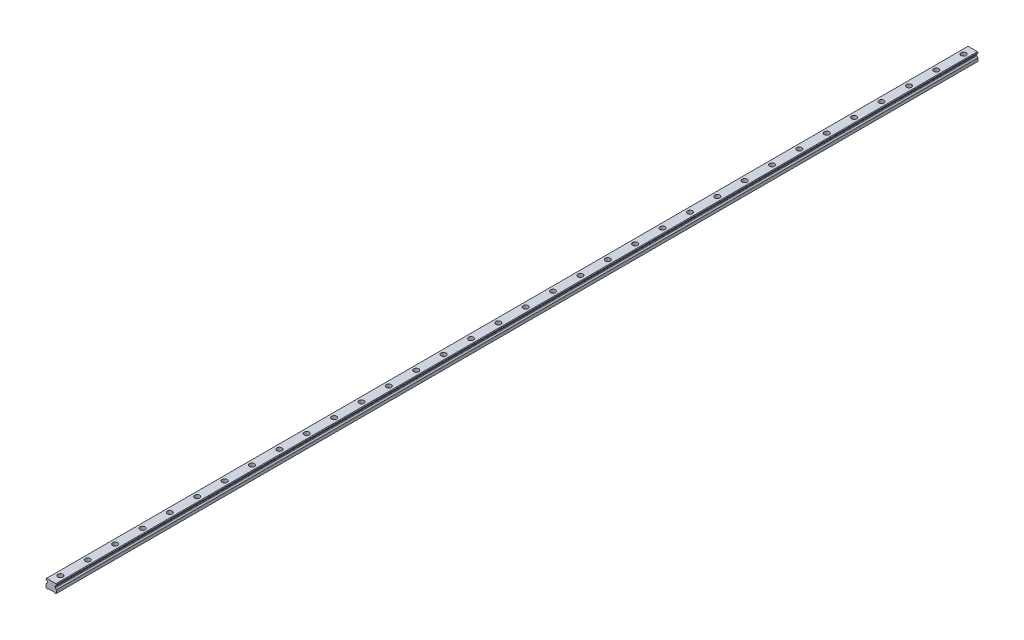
from build123d import *

# Parameters (mm, degrees)
SKETCH1_W           = 23
SKETCH1_H           = 19.2
BOSS_EXTRUDE1_DEPTH = 1010
CUT_EXTRUDE1_DEPTH  = 2021.123978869
CHAMFER1_SIZE       = 1.25
FILLET1_R           = 1.25
CUT_EXTRUDE2_DEPTH  = 2021.123978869
SKETCH4_R           = 5.5
SKETCH4_R_2         = 3.5
CUT_EXTRUDE3_DEPTH  = 9
SKETCH4_2_R         = 3.5
CUT_EXTRUDE4_DEPTH  = 1011.247934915
LPATTERN1_COUNT     = 34
LPATTERN1_PITCH     = 60


with BuildPart() as part:
    # Sketch1 → Boss-Extrude1 (new, symmetric)
    with BuildSketch(Plane.XY):
        with Locations((0, 9.6)):
            Rectangle(SKETCH1_W, SKETCH1_H)
    extrude(amount=BOSS_EXTRUDE1_DEPTH, both=True)

    # Sketch2 → Cut-Extrude1 (cut, through all)
    with BuildSketch(Plane.XY.offset(1010)):
        Polygon((-11.5, 16.7), (-11.5, 7.95), (-8.583333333, 10.866666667), (-8.583333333, 13.783333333), align=None)
        Polygon((8.583333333, 13.783333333), (11.5, 16.7), (11.5, 7.95), (8.583333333, 10.866666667), align=None)
    extrude(amount=-CUT_EXTRUDE1_DEPTH, mode=Mode.SUBTRACT)

    # Chamfer1
    chamfer1_edges = [part.edges().sort_by_distance(p)[0] for p in [
        (-11.5, 19.2, 0),
        (11.5, 19.2, 0),
        (11.5, 0, 0),
        (-11.5, 0, 0),
    ]]
    chamfer(chamfer1_edges, length=CHAMFER1_SIZE)

    # Fillet1
    fillet1_edges = [part.edges().sort_by_distance(p)[0] for p in [
        (-8.583333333, 13.783333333, 0),
        (-8.583333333, 10.866666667, 0),
        (8.583333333, 10.866666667, 0),
        (8.583333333, 13.783333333, 0),
    ]]
    fillet(fillet1_edges, radius=FILLET1_R)

    # Sketch3 → Cut-Extrude2 (cut, through all)
    with BuildSketch(Plane.XY.offset(1010)):
        Polygon((-7, 0), (-5.75, 1.25), (5.75, 1.25), (7, 0), align=None)
    extrude(amount=-CUT_EXTRUDE2_DEPTH, mode=Mode.SUBTRACT)

    # Sketch4 → Cut-Extrude3 (cut)
    with BuildSketch(Plane(origin=(0, 19.2, 0), x_dir=(1, 0, 0), z_dir=(0, 1, 0))):
        with Locations(Location((0, -990, 0), (0, 0, 270))):
            Circle(SKETCH4_R)
        with Locations(Location((0, -990, 0), (0, 0, 270))):
            Circle(SKETCH4_R_2, mode=Mode.SUBTRACT)
    cut_extrude3 = extrude(amount=-CUT_EXTRUDE3_DEPTH, mode=Mode.SUBTRACT)

    # Sketch4_2 → Cut-Extrude4 (cut, through all)
    with BuildSketch(Plane(origin=(0, 19.2, 0), x_dir=(1, 0, 0), z_dir=(0, 1, 0))):
        with Locations(Location((0, -990, 0), (0, 0, 270))):
            Circle(SKETCH4_2_R)
    cut_extrude4 = extrude(amount=-CUT_EXTRUDE4_DEPTH, mode=Mode.SUBTRACT)

    # LPattern1: Cut-Extrude3, Cut-Extrude4 ×34
    with Locations(*[(0, 0, -i * LPATTERN1_PITCH) for i in range(1, LPATTERN1_COUNT)]):
        add(cut_extrude3, mode=Mode.SUBTRACT)
        add(cut_extrude4, mode=Mode.SUBTRACT)


solid = part.part
